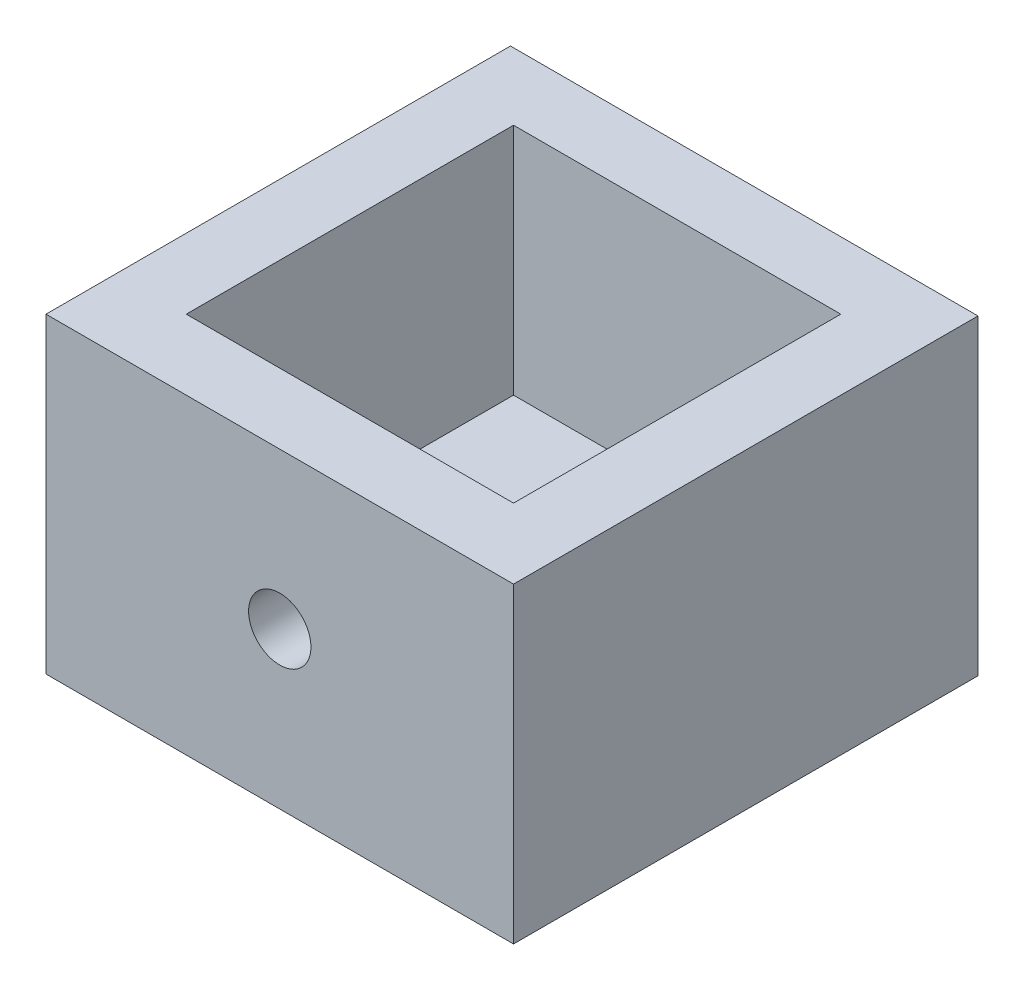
ISO-10303-21;
HEADER;
FILE_DESCRIPTION(('STEP AP214'),'2;1');
FILE_NAME('part.step','',(''),(''),'','','');
FILE_SCHEMA(('AUTOMOTIVE_DESIGN { 1 0 10303 214 1 1 1 1 }'));
ENDSEC;
DATA;
#1=APPLICATION_CONTEXT('core data for automotive mechanical design processes');
#2=APPLICATION_PROTOCOL_DEFINITION('international standard','automotive_design',2000,#1);
#3=PRODUCT_CONTEXT('',#1,'mechanical');
#4=PRODUCT('Part','Part','',(#3));
#5=PRODUCT_RELATED_PRODUCT_CATEGORY('part','',(#4));
#6=PRODUCT_DEFINITION_FORMATION('','',#4);
#7=PRODUCT_DEFINITION_CONTEXT('part definition',#1,'design');
#8=PRODUCT_DEFINITION('design','',#6,#7);
#9=PRODUCT_DEFINITION_SHAPE('','',#8);
#10=(LENGTH_UNIT() NAMED_UNIT(*) SI_UNIT(.MILLI.,.METRE.));
#11=(NAMED_UNIT(*) PLANE_ANGLE_UNIT() SI_UNIT($,.RADIAN.));
#12=(NAMED_UNIT(*) SI_UNIT($,.STERADIAN.) SOLID_ANGLE_UNIT());
#13=UNCERTAINTY_MEASURE_WITH_UNIT(LENGTH_MEASURE(1.E-05),#10,'distance_accuracy_value','');
#14=(GEOMETRIC_REPRESENTATION_CONTEXT(3) GLOBAL_UNCERTAINTY_ASSIGNED_CONTEXT((#13)) GLOBAL_UNIT_ASSIGNED_CONTEXT((#10,
#11,#12)) REPRESENTATION_CONTEXT('',''));
#15=CARTESIAN_POINT('',(0.,0.,0.));
#16=DIRECTION('',(0.,0.,1.));
#17=DIRECTION('',(1.,0.,0.));
#18=AXIS2_PLACEMENT_3D('',#15,#16,#17);
#19=CARTESIAN_POINT('',(-41.91,12.7,15.));
#20=DIRECTION('',(0.,-1.,0.));
#21=DIRECTION('',(0.,0.,-1.));
#22=AXIS2_PLACEMENT_3D('',#19,#20,#21);
#23=PLANE('',#22);
#24=DIRECTION('',(-1.,0.,0.));
#25=VECTOR('',#24,1.);
#26=CARTESIAN_POINT('',(-13.335,12.7,20.715));
#27=LINE('',#26,#25);
#28=CARTESIAN_POINT('',(13.335,12.7,20.715));
#29=VERTEX_POINT('',#28);
#30=CARTESIAN_POINT('',(-13.335,12.7,20.715));
#31=VERTEX_POINT('',#30);
#32=EDGE_CURVE('E165',#29,#31,#27,.T.);
#33=ORIENTED_EDGE('',*,*,#32,.F.);
#34=DIRECTION('',(0.,0.,-1.));
#35=VECTOR('',#34,1.);
#36=CARTESIAN_POINT('',(13.335,12.7,47.385));
#37=LINE('',#36,#35);
#38=CARTESIAN_POINT('',(13.335,12.7,47.385));
#39=VERTEX_POINT('',#38);
#40=EDGE_CURVE('E62',#39,#29,#37,.T.);
#41=ORIENTED_EDGE('',*,*,#40,.F.);
#42=DIRECTION('',(1.,0.,0.));
#43=VECTOR('',#42,1.);
#44=CARTESIAN_POINT('',(-13.335,12.7,47.385));
#45=LINE('',#44,#43);
#46=CARTESIAN_POINT('',(-13.335,12.7,47.385));
#47=VERTEX_POINT('',#46);
#48=EDGE_CURVE('E154',#47,#39,#45,.T.);
#49=ORIENTED_EDGE('',*,*,#48,.F.);
#50=DIRECTION('',(0.,0.,1.));
#51=VECTOR('',#50,1.);
#52=CARTESIAN_POINT('',(-13.335,12.7,47.385));
#53=LINE('',#52,#51);
#54=EDGE_CURVE('E168',#31,#47,#53,.T.);
#55=ORIENTED_EDGE('',*,*,#54,.F.);
#56=EDGE_LOOP('',(#33,#41,#49,#55));
#57=FACE_BOUND('',#56,.T.);
#58=DIRECTION('',(0.,0.,-1.));
#59=VECTOR('',#58,1.);
#60=CARTESIAN_POINT('',(19.05,12.7,53.1));
#61=LINE('',#60,#59);
#62=CARTESIAN_POINT('',(19.05,12.7,53.1));
#63=VERTEX_POINT('',#62);
#64=CARTESIAN_POINT('',(19.05,12.7,15.2500000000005));
#65=VERTEX_POINT('',#64);
#66=EDGE_CURVE('E11',#63,#65,#61,.T.);
#67=ORIENTED_EDGE('',*,*,#66,.T.);
#68=DIRECTION('',(-1.,0.,0.));
#69=VECTOR('',#68,1.);
#70=CARTESIAN_POINT('',(-41.91,12.7,15.2500000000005));
#71=LINE('',#70,#69);
#72=CARTESIAN_POINT('',(-19.05,12.7,15.2500000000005));
#73=VERTEX_POINT('',#72);
#74=EDGE_CURVE('E105',#65,#73,#71,.T.);
#75=ORIENTED_EDGE('',*,*,#74,.T.);
#76=DIRECTION('',(0.,0.,-1.));
#77=VECTOR('',#76,1.);
#78=CARTESIAN_POINT('',(-19.05,12.7,53.1));
#79=LINE('',#78,#77);
#80=CARTESIAN_POINT('',(-19.05,12.7,53.1));
#81=VERTEX_POINT('',#80);
#82=EDGE_CURVE('E47',#81,#73,#79,.T.);
#83=ORIENTED_EDGE('',*,*,#82,.F.);
#84=DIRECTION('',(-1.,0.,0.));
#85=VECTOR('',#84,1.);
#86=CARTESIAN_POINT('',(-19.05,12.7,53.1));
#87=LINE('',#86,#85);
#88=EDGE_CURVE('E137',#63,#81,#87,.T.);
#89=ORIENTED_EDGE('',*,*,#88,.F.);
#90=EDGE_LOOP('',(#67,#75,#83,#89));
#91=FACE_BOUND('',#90,.T.);
#92=ADVANCED_FACE('F39',(#57,#91),#23,.F.);
#93=CARTESIAN_POINT('',(-41.91,-12.7,15.));
#94=DIRECTION('',(0.,1.,0.));
#95=DIRECTION('',(0.,0.,1.));
#96=AXIS2_PLACEMENT_3D('',#93,#94,#95);
#97=PLANE('',#96);
#98=CARTESIAN_POINT('',(0.,-12.7,34.05));
#99=DIRECTION('',(0.,1.,0.));
#100=DIRECTION('',(0.,0.,1.));
#101=AXIS2_PLACEMENT_3D('',#98,#99,#100);
#102=CIRCLE('',#101,3.429);
#103=CARTESIAN_POINT('',(0.,-12.7,37.479));
#104=VERTEX_POINT('',#103);
#105=EDGE_CURVE('E144',#104,#104,#102,.T.);
#106=ORIENTED_EDGE('',*,*,#105,.T.);
#107=EDGE_LOOP('',(#106));
#108=FACE_BOUND('',#107,.T.);
#109=DIRECTION('',(0.,0.,-1.));
#110=VECTOR('',#109,1.);
#111=CARTESIAN_POINT('',(-19.05,-12.7,53.1));
#112=LINE('',#111,#110);
#113=CARTESIAN_POINT('',(-19.05,-12.7,53.1));
#114=VERTEX_POINT('',#113);
#115=CARTESIAN_POINT('',(-19.05,-12.7,15.2500000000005));
#116=VERTEX_POINT('',#115);
#117=EDGE_CURVE('E119',#114,#116,#112,.T.);
#118=ORIENTED_EDGE('',*,*,#117,.T.);
#119=DIRECTION('',(-1.,0.,0.));
#120=VECTOR('',#119,1.);
#121=CARTESIAN_POINT('',(-19.05,-12.7,15.2500000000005));
#122=LINE('',#121,#120);
#123=CARTESIAN_POINT('',(19.05,-12.7,15.2500000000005));
#124=VERTEX_POINT('',#123);
#125=EDGE_CURVE('E54',#124,#116,#122,.T.);
#126=ORIENTED_EDGE('',*,*,#125,.F.);
#127=DIRECTION('',(0.,0.,-1.));
#128=VECTOR('',#127,1.);
#129=CARTESIAN_POINT('',(19.05,-12.7,53.1));
#130=LINE('',#129,#128);
#131=CARTESIAN_POINT('',(19.05,-12.7,53.1));
#132=VERTEX_POINT('',#131);
#133=EDGE_CURVE('E116',#132,#124,#130,.T.);
#134=ORIENTED_EDGE('',*,*,#133,.F.);
#135=DIRECTION('',(1.,0.,0.));
#136=VECTOR('',#135,1.);
#137=CARTESIAN_POINT('',(-19.05,-12.7,53.1));
#138=LINE('',#137,#136);
#139=EDGE_CURVE('E124',#114,#132,#138,.T.);
#140=ORIENTED_EDGE('',*,*,#139,.F.);
#141=EDGE_LOOP('',(#118,#126,#134,#140));
#142=FACE_BOUND('',#141,.T.);
#143=ADVANCED_FACE('F114',(#108,#142),#97,.F.);
#144=CARTESIAN_POINT('',(19.05,-12.7,53.1));
#145=DIRECTION('',(-1.,0.,0.));
#146=DIRECTION('',(0.,0.,1.));
#147=AXIS2_PLACEMENT_3D('',#144,#145,#146);
#148=PLANE('',#147);
#149=ORIENTED_EDGE('',*,*,#133,.T.);
#150=DIRECTION('',(0.,-1.,0.));
#151=VECTOR('',#150,1.);
#152=CARTESIAN_POINT('',(19.05,37.3,15.2500000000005));
#153=LINE('',#152,#151);
#154=EDGE_CURVE('E102',#65,#124,#153,.T.);
#155=ORIENTED_EDGE('',*,*,#154,.F.);
#156=ORIENTED_EDGE('',*,*,#66,.F.);
#157=DIRECTION('',(0.,1.,0.));
#158=VECTOR('',#157,1.);
#159=CARTESIAN_POINT('',(19.05,-12.7,53.1));
#160=LINE('',#159,#158);
#161=EDGE_CURVE('E123',#132,#63,#160,.T.);
#162=ORIENTED_EDGE('',*,*,#161,.F.);
#163=EDGE_LOOP('',(#149,#155,#156,#162));
#164=FACE_BOUND('',#163,.T.);
#165=ADVANCED_FACE('F121',(#164),#148,.F.);
#166=CARTESIAN_POINT('',(-19.05,-12.7,53.1));
#167=DIRECTION('',(1.,0.,0.));
#168=DIRECTION('',(0.,0.,-1.));
#169=AXIS2_PLACEMENT_3D('',#166,#167,#168);
#170=PLANE('',#169);
#171=ORIENTED_EDGE('',*,*,#82,.T.);
#172=DIRECTION('',(0.,-1.,0.));
#173=VECTOR('',#172,1.);
#174=CARTESIAN_POINT('',(-19.05,37.3,15.2500000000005));
#175=LINE('',#174,#173);
#176=EDGE_CURVE('E109',#73,#116,#175,.T.);
#177=ORIENTED_EDGE('',*,*,#176,.T.);
#178=ORIENTED_EDGE('',*,*,#117,.F.);
#179=DIRECTION('',(0.,-1.,0.));
#180=VECTOR('',#179,1.);
#181=CARTESIAN_POINT('',(-19.05,-12.7,53.1));
#182=LINE('',#181,#180);
#183=EDGE_CURVE('E127',#81,#114,#182,.T.);
#184=ORIENTED_EDGE('',*,*,#183,.F.);
#185=EDGE_LOOP('',(#171,#177,#178,#184));
#186=FACE_BOUND('',#185,.T.);
#187=ADVANCED_FACE('F135',(#186),#170,.F.);
#188=CARTESIAN_POINT('',(0.,0.,53.1));
#189=DIRECTION('',(0.,0.,-1.));
#190=DIRECTION('',(-1.,0.,0.));
#191=AXIS2_PLACEMENT_3D('',#188,#189,#190);
#192=PLANE('',#191);
#193=CARTESIAN_POINT('',(0.,0.,53.1));
#194=DIRECTION('',(0.,0.,1.));
#195=DIRECTION('',(1.,0.,0.));
#196=AXIS2_PLACEMENT_3D('',#193,#194,#195);
#197=CIRCLE('',#196,2.54);
#198=CARTESIAN_POINT('',(2.54,0.,53.1));
#199=VERTEX_POINT('',#198);
#200=EDGE_CURVE('E138',#199,#199,#197,.T.);
#201=ORIENTED_EDGE('',*,*,#200,.F.);
#202=EDGE_LOOP('',(#201));
#203=FACE_BOUND('',#202,.T.);
#204=ORIENTED_EDGE('',*,*,#161,.T.);
#205=ORIENTED_EDGE('',*,*,#88,.T.);
#206=ORIENTED_EDGE('',*,*,#183,.T.);
#207=ORIENTED_EDGE('',*,*,#139,.T.);
#208=EDGE_LOOP('',(#204,#205,#206,#207));
#209=FACE_BOUND('',#208,.T.);
#210=ADVANCED_FACE('F182',(#203,#209),#192,.F.);
#211=CARTESIAN_POINT('',(13.335,-6.35,47.385));
#212=DIRECTION('',(1.,0.,0.));
#213=DIRECTION('',(0.,0.,-1.));
#214=AXIS2_PLACEMENT_3D('',#211,#212,#213);
#215=PLANE('',#214);
#216=ORIENTED_EDGE('',*,*,#40,.T.);
#217=DIRECTION('',(0.,1.,0.));
#218=VECTOR('',#217,1.);
#219=CARTESIAN_POINT('',(13.335,-6.35,20.715));
#220=LINE('',#219,#218);
#221=CARTESIAN_POINT('',(13.335,-6.35,20.715));
#222=VERTEX_POINT('',#221);
#223=EDGE_CURVE('E163',#222,#29,#220,.T.);
#224=ORIENTED_EDGE('',*,*,#223,.F.);
#225=DIRECTION('',(0.,0.,-1.));
#226=VECTOR('',#225,1.);
#227=CARTESIAN_POINT('',(13.335,-6.35,47.385));
#228=LINE('',#227,#226);
#229=CARTESIAN_POINT('',(13.335,-6.35,47.385));
#230=VERTEX_POINT('',#229);
#231=EDGE_CURVE('E150',#230,#222,#228,.T.);
#232=ORIENTED_EDGE('',*,*,#231,.F.);
#233=DIRECTION('',(0.,1.,0.));
#234=VECTOR('',#233,1.);
#235=CARTESIAN_POINT('',(13.335,-6.35,47.385));
#236=LINE('',#235,#234);
#237=EDGE_CURVE('E173',#230,#39,#236,.T.);
#238=ORIENTED_EDGE('',*,*,#237,.T.);
#239=EDGE_LOOP('',(#216,#224,#232,#238));
#240=FACE_BOUND('',#239,.T.);
#241=ADVANCED_FACE('F184',(#240),#215,.F.);
#242=CARTESIAN_POINT('',(-13.335,-6.35,47.385));
#243=DIRECTION('',(0.,0.,1.));
#244=DIRECTION('',(1.,0.,0.));
#245=AXIS2_PLACEMENT_3D('',#242,#243,#244);
#246=PLANE('',#245);
#247=CARTESIAN_POINT('',(0.,0.,47.385));
#248=DIRECTION('',(0.,0.,1.));
#249=DIRECTION('',(1.,0.,0.));
#250=AXIS2_PLACEMENT_3D('',#247,#248,#249);
#251=CIRCLE('',#250,2.54);
#252=CARTESIAN_POINT('',(2.54,0.,47.385));
#253=VERTEX_POINT('',#252);
#254=EDGE_CURVE('E42',#253,#253,#251,.T.);
#255=ORIENTED_EDGE('',*,*,#254,.T.);
#256=EDGE_LOOP('',(#255));
#257=FACE_BOUND('',#256,.T.);
#258=ORIENTED_EDGE('',*,*,#48,.T.);
#259=ORIENTED_EDGE('',*,*,#237,.F.);
#260=DIRECTION('',(1.,0.,0.));
#261=VECTOR('',#260,1.);
#262=CARTESIAN_POINT('',(-13.335,-6.35,47.385));
#263=LINE('',#262,#261);
#264=CARTESIAN_POINT('',(-13.335,-6.35,47.385));
#265=VERTEX_POINT('',#264);
#266=EDGE_CURVE('E160',#265,#230,#263,.T.);
#267=ORIENTED_EDGE('',*,*,#266,.F.);
#268=DIRECTION('',(0.,1.,0.));
#269=VECTOR('',#268,1.);
#270=CARTESIAN_POINT('',(-13.335,-6.35,47.385));
#271=LINE('',#270,#269);
#272=EDGE_CURVE('E175',#265,#47,#271,.T.);
#273=ORIENTED_EDGE('',*,*,#272,.T.);
#274=EDGE_LOOP('',(#258,#259,#267,#273));
#275=FACE_BOUND('',#274,.T.);
#276=ADVANCED_FACE('F192',(#257,#275),#246,.F.);
#277=CARTESIAN_POINT('',(-13.335,-6.35,47.385));
#278=DIRECTION('',(-1.,0.,0.));
#279=DIRECTION('',(0.,0.,1.));
#280=AXIS2_PLACEMENT_3D('',#277,#278,#279);
#281=PLANE('',#280);
#282=ORIENTED_EDGE('',*,*,#54,.T.);
#283=ORIENTED_EDGE('',*,*,#272,.F.);
#284=DIRECTION('',(0.,0.,1.));
#285=VECTOR('',#284,1.);
#286=CARTESIAN_POINT('',(-13.335,-6.35,47.385));
#287=LINE('',#286,#285);
#288=CARTESIAN_POINT('',(-13.335,-6.35,20.715));
#289=VERTEX_POINT('',#288);
#290=EDGE_CURVE('E157',#289,#265,#287,.T.);
#291=ORIENTED_EDGE('',*,*,#290,.F.);
#292=DIRECTION('',(0.,1.,0.));
#293=VECTOR('',#292,1.);
#294=CARTESIAN_POINT('',(-13.335,-6.35,20.715));
#295=LINE('',#294,#293);
#296=EDGE_CURVE('E177',#289,#31,#295,.T.);
#297=ORIENTED_EDGE('',*,*,#296,.T.);
#298=EDGE_LOOP('',(#282,#283,#291,#297));
#299=FACE_BOUND('',#298,.T.);
#300=ADVANCED_FACE('F217',(#299),#281,.F.);
#301=CARTESIAN_POINT('',(-13.335,-6.35,20.715));
#302=DIRECTION('',(0.,0.,-1.));
#303=DIRECTION('',(-1.,0.,0.));
#304=AXIS2_PLACEMENT_3D('',#301,#302,#303);
#305=PLANE('',#304);
#306=ORIENTED_EDGE('',*,*,#32,.T.);
#307=ORIENTED_EDGE('',*,*,#296,.F.);
#308=DIRECTION('',(-1.,0.,0.));
#309=VECTOR('',#308,1.);
#310=CARTESIAN_POINT('',(-13.335,-6.35,20.715));
#311=LINE('',#310,#309);
#312=EDGE_CURVE('E153',#222,#289,#311,.T.);
#313=ORIENTED_EDGE('',*,*,#312,.F.);
#314=ORIENTED_EDGE('',*,*,#223,.T.);
#315=EDGE_LOOP('',(#306,#307,#313,#314));
#316=FACE_BOUND('',#315,.T.);
#317=ADVANCED_FACE('F208',(#316),#305,.F.);
#318=CARTESIAN_POINT('',(0.,-6.35,0.));
#319=DIRECTION('',(0.,-1.,0.));
#320=DIRECTION('',(0.,0.,-1.));
#321=AXIS2_PLACEMENT_3D('',#318,#319,#320);
#322=PLANE('',#321);
#323=CARTESIAN_POINT('',(0.,-6.35,34.05));
#324=DIRECTION('',(0.,1.,0.));
#325=DIRECTION('',(0.,0.,1.));
#326=AXIS2_PLACEMENT_3D('',#323,#324,#325);
#327=CIRCLE('',#326,3.429);
#328=CARTESIAN_POINT('',(0.,-6.35,37.479));
#329=VERTEX_POINT('',#328);
#330=EDGE_CURVE('E147',#329,#329,#327,.T.);
#331=ORIENTED_EDGE('',*,*,#330,.F.);
#332=EDGE_LOOP('',(#331));
#333=FACE_BOUND('',#332,.T.);
#334=ORIENTED_EDGE('',*,*,#231,.T.);
#335=ORIENTED_EDGE('',*,*,#312,.T.);
#336=ORIENTED_EDGE('',*,*,#290,.T.);
#337=ORIENTED_EDGE('',*,*,#266,.T.);
#338=EDGE_LOOP('',(#334,#335,#336,#337));
#339=FACE_BOUND('',#338,.T.);
#340=ADVANCED_FACE('F214',(#333,#339),#322,.F.);
#341=CARTESIAN_POINT('',(0.,-12.7,34.05));
#342=DIRECTION('',(0.,1.,0.));
#343=DIRECTION('',(0.,0.,1.));
#344=AXIS2_PLACEMENT_3D('',#341,#342,#343);
#345=CYLINDRICAL_SURFACE('',#344,3.429);
#346=ORIENTED_EDGE('',*,*,#105,.F.);
#347=EDGE_LOOP('',(#346));
#348=FACE_BOUND('',#347,.T.);
#349=ORIENTED_EDGE('',*,*,#330,.T.);
#350=EDGE_LOOP('',(#349));
#351=FACE_BOUND('',#350,.T.);
#352=ADVANCED_FACE('F229',(#348,#351),#345,.F.);
#353=CARTESIAN_POINT('',(0.,0.,43.1));
#354=DIRECTION('',(0.,0.,1.));
#355=DIRECTION('',(1.,0.,0.));
#356=AXIS2_PLACEMENT_3D('',#353,#354,#355);
#357=CYLINDRICAL_SURFACE('',#356,2.54);
#358=ORIENTED_EDGE('',*,*,#200,.T.);
#359=EDGE_LOOP('',(#358));
#360=FACE_BOUND('',#359,.T.);
#361=ORIENTED_EDGE('',*,*,#254,.F.);
#362=EDGE_LOOP('',(#361));
#363=FACE_BOUND('',#362,.T.);
#364=ADVANCED_FACE('F232',(#360,#363),#357,.F.);
#365=CARTESIAN_POINT('',(-19.05,37.3,15.2500000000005));
#366=DIRECTION('',(0.,0.,1.));
#367=DIRECTION('',(1.,0.,0.));
#368=AXIS2_PLACEMENT_3D('',#365,#366,#367);
#369=PLANE('',#368);
#370=ORIENTED_EDGE('',*,*,#154,.T.);
#371=ORIENTED_EDGE('',*,*,#125,.T.);
#372=ORIENTED_EDGE('',*,*,#176,.F.);
#373=ORIENTED_EDGE('',*,*,#74,.F.);
#374=EDGE_LOOP('',(#370,#371,#372,#373));
#375=FACE_BOUND('',#374,.T.);
#376=ADVANCED_FACE('F103',(#375),#369,.F.);
#377=CLOSED_SHELL('',(#92,#143,#165,#187,#210,#241,#276,#300,#317,#340,#352,#364,#376));
#378=MANIFOLD_SOLID_BREP('B2',#377);
#379=ADVANCED_BREP_SHAPE_REPRESENTATION('',(#18,#378),#14);
#380=SHAPE_DEFINITION_REPRESENTATION(#9,#379);
ENDSEC;
END-ISO-10303-21;
